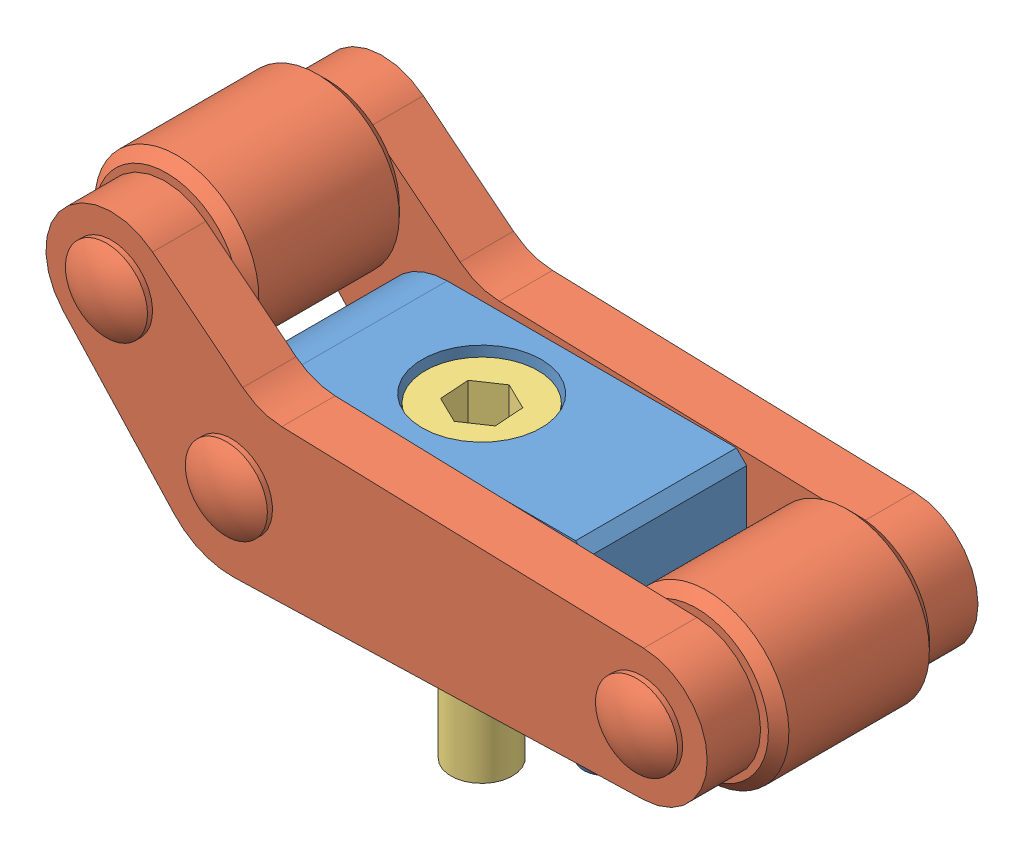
SolidWorks assembly ACCPM20.SLDASM, configuration Default (file format 13000). Lengths in mm.
Overall size (33.85 21.46 15).
3 component instances, 3 part files, 4 mates.
Components (placement in the parent):
- ACCPM20-Body-1: ACCPM20-Body.sldprt [Default] at origin size (18 12.4 7.84)
- ACCPM20-ARMS-1: ACCPM20-ARMS.sldprt [Default] at (-0.1 0 0) size (33.85 13.46 15)
- SHCSM3-.5L12-1: SHCSM3-.5L12.sldprt [SHCSM3-.5L12] at (-6 4 0) x (-0.997611 0 0.069088) z (0 -1 0) size (5.5 5.5 15)
Mates (geometry in assembly coordinates):
- Concentric1: concentric anti-aligned: cylinder of ACCPM20-Body-1 through (-11.6 4 -3.92) axis (0 0 1) radius 2.25; cylinder of ACCPM20-ARMS-1 through (-11.6 4 -4.2749) axis (0 0 -1) radius 2.25
- Coincident1: coincident aligned: plane of EPA20-ARMS-1 through (-0.1 0 0) normal (0 0 1)
- Tangent1: tangent aligned: plane of ACCPM20-Body-1 through (3 0 -3.92) normal (0 -1 0); cylinder of ACCPM20-ARMS-1 through (8.4 4 -3.93) axis (0 0 -1) radius 4
- ProfileCenter1: profile center aligned: circle of SHCSM3-.5L12-1; circle of ACCPM20-Body-1
